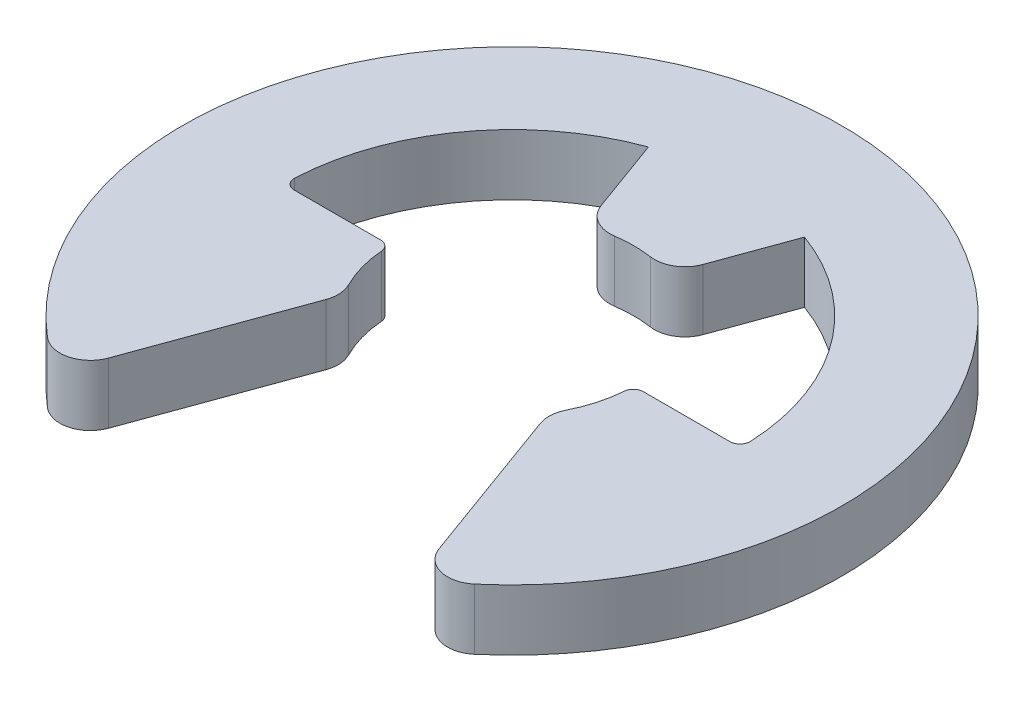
from build123d import *

# Parameters (mm, degrees)
BOSS_EXTRUDE1_DEPTH = 0.15
FILLET1_R           = 0.15
FILLET2_R           = 0.05


with BuildPart() as part:
    # Sketch2 → Boss-Extrude1 (new, symmetric)
    with BuildSketch(Plane(origin=(0, 0, 0), x_dir=(1, 0, 0), z_dir=(0, 1, 0))):
        with BuildLine():
            Line((-0.883476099, -1.363852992), (-0.505, -0.323998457))
            ThreePointArc((-0.505, -0.323998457), (-0.575760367, -0.16881943), (-0.6, 0))
            Line((-0.6, 0), (-1.125, 0))
            ThreePointArc((-1.125, 0), (-0.92154605, 0.645273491), (-0.384772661, 1.057154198))
            Line((-0.384772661, 1.057154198), (-0.205212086, 0.563815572))
            ThreePointArc((-0.205212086, 0.563815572), (0, 0.6), (0.205212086, 0.563815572))
            Line((0.205212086, 0.563815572), (0.384772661, 1.057154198))
            ThreePointArc((0.384772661, 1.057154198), (0.92154605, 0.645273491), (1.125, 0))
            Line((1.125, 0), (0.6, 0))
            ThreePointArc((0.6, 0), (0.575760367, -0.16881943), (0.505, -0.323998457))
            Line((0.505, -0.323998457), (0.883476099, -1.363852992))
            ThreePointArc((0.883476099, -1.363852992), (0, 1.625), (-0.883476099, -1.363852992))
        make_face()
    extrude(amount=BOSS_EXTRUDE1_DEPTH, both=True)

    # Fillet1
    fillet1_edges = [part.edges().sort_by_distance(p)[0] for p in [
        (-0.505, 0, 0.323998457),
        (-0.883476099, 0, 1.363852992),
        (0.883476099, 0, 1.363852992),
        (0.505, 0, 0.323998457),
        (0.205212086, 0, -0.563815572),
        (-0.205212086, 0, -0.563815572),
    ]]
    fillet(fillet1_edges, radius=FILLET1_R)

    # Fillet2
    fillet2_edges = [part.edges().sort_by_distance(p)[0] for p in [
        (-1.125, 0, 0),
        (-0.6, 0, 0),
        (0.6, 0, 0),
        (1.125, 0, 0),
    ]]
    fillet(fillet2_edges, radius=FILLET2_R)


solid = part.part
